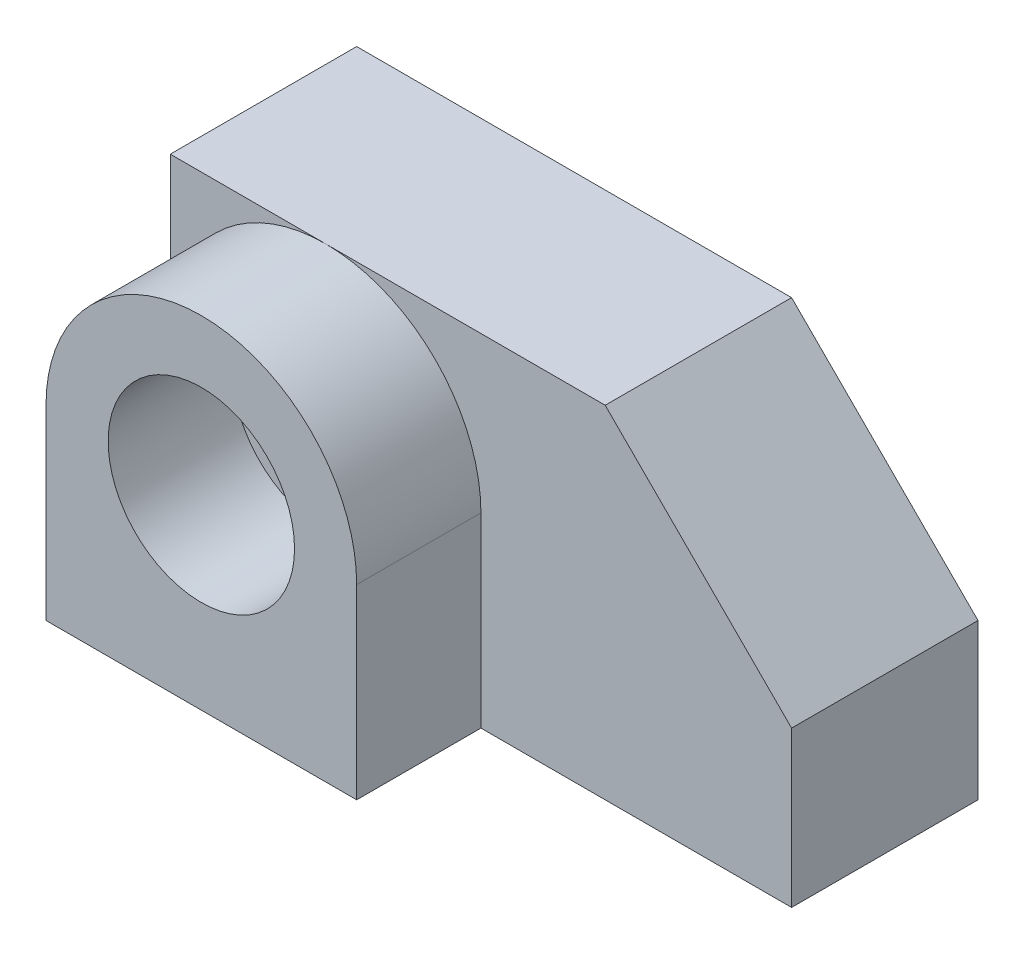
ISO-10303-21;
HEADER;
FILE_DESCRIPTION(('STEP AP214'),'2;1');
FILE_NAME('part.step','',(''),(''),'','','');
FILE_SCHEMA(('AUTOMOTIVE_DESIGN { 1 0 10303 214 1 1 1 1 }'));
ENDSEC;
DATA;
#1=APPLICATION_CONTEXT('core data for automotive mechanical design processes');
#2=APPLICATION_PROTOCOL_DEFINITION('international standard','automotive_design',2000,#1);
#3=PRODUCT_CONTEXT('',#1,'mechanical');
#4=PRODUCT('Part','Part','',(#3));
#5=PRODUCT_RELATED_PRODUCT_CATEGORY('part','',(#4));
#6=PRODUCT_DEFINITION_FORMATION('','',#4);
#7=PRODUCT_DEFINITION_CONTEXT('part definition',#1,'design');
#8=PRODUCT_DEFINITION('design','',#6,#7);
#9=PRODUCT_DEFINITION_SHAPE('','',#8);
#10=(LENGTH_UNIT() NAMED_UNIT(*) SI_UNIT(.MILLI.,.METRE.));
#11=(NAMED_UNIT(*) PLANE_ANGLE_UNIT() SI_UNIT($,.RADIAN.));
#12=(NAMED_UNIT(*) SI_UNIT($,.STERADIAN.) SOLID_ANGLE_UNIT());
#13=UNCERTAINTY_MEASURE_WITH_UNIT(LENGTH_MEASURE(1.E-05),#10,'distance_accuracy_value','');
#14=(GEOMETRIC_REPRESENTATION_CONTEXT(3) GLOBAL_UNCERTAINTY_ASSIGNED_CONTEXT((#13)) GLOBAL_UNIT_ASSIGNED_CONTEXT((#10,
#11,#12)) REPRESENTATION_CONTEXT('',''));
#15=CARTESIAN_POINT('',(0.,0.,0.));
#16=DIRECTION('',(0.,0.,1.));
#17=DIRECTION('',(1.,0.,0.));
#18=AXIS2_PLACEMENT_3D('',#15,#16,#17);
#19=CARTESIAN_POINT('',(-50.,55.,0.));
#20=DIRECTION('',(0.,0.,-1.));
#21=DIRECTION('',(-1.,0.,0.));
#22=AXIS2_PLACEMENT_3D('',#19,#20,#21);
#23=PLANE('',#22);
#24=CARTESIAN_POINT('',(-25.,30.,0.));
#25=DIRECTION('',(0.,0.,1.));
#26=DIRECTION('',(1.,0.,0.));
#27=AXIS2_PLACEMENT_3D('',#24,#25,#26);
#28=CIRCLE('',#27,25.);
#29=CARTESIAN_POINT('',(-25.,55.,0.));
#30=VERTEX_POINT('',#29);
#31=CARTESIAN_POINT('',(-50.,30.,0.));
#32=VERTEX_POINT('',#31);
#33=EDGE_CURVE('E11',#30,#32,#28,.T.);
#34=ORIENTED_EDGE('',*,*,#33,.F.);
#35=DIRECTION('',(-1.,0.,0.));
#36=VECTOR('',#35,1.);
#37=CARTESIAN_POINT('',(-50.,55.,0.));
#38=LINE('',#37,#36);
#39=CARTESIAN_POINT('',(-50.,55.,0.));
#40=VERTEX_POINT('',#39);
#41=EDGE_CURVE('E175',#30,#40,#38,.T.);
#42=ORIENTED_EDGE('',*,*,#41,.T.);
#43=DIRECTION('',(0.,-1.,0.));
#44=VECTOR('',#43,1.);
#45=CARTESIAN_POINT('',(-50.,0.,0.));
#46=LINE('',#45,#44);
#47=EDGE_CURVE('E56',#40,#32,#46,.T.);
#48=ORIENTED_EDGE('',*,*,#47,.T.);
#49=EDGE_LOOP('',(#34,#42,#48));
#50=FACE_BOUND('',#49,.T.);
#51=ADVANCED_FACE('F31',(#50),#23,.F.);
#52=CARTESIAN_POINT('',(0.,30.,0.));
#53=VERTEX_POINT('',#52);
#54=EDGE_CURVE('E134',#53,#30,#28,.T.);
#55=ORIENTED_EDGE('',*,*,#54,.F.);
#56=DIRECTION('',(0.,1.,0.));
#57=VECTOR('',#56,1.);
#58=CARTESIAN_POINT('',(0.,0.,0.));
#59=LINE('',#58,#57);
#60=CARTESIAN_POINT('',(0.,0.,0.));
#61=VERTEX_POINT('',#60);
#62=EDGE_CURVE('E48',#61,#53,#59,.T.);
#63=ORIENTED_EDGE('',*,*,#62,.F.);
#64=DIRECTION('',(1.,0.,0.));
#65=VECTOR('',#64,1.);
#66=CARTESIAN_POINT('',(-50.,0.,0.));
#67=LINE('',#66,#65);
#68=CARTESIAN_POINT('',(50.,0.,0.));
#69=VERTEX_POINT('',#68);
#70=EDGE_CURVE('E124',#61,#69,#67,.T.);
#71=ORIENTED_EDGE('',*,*,#70,.T.);
#72=DIRECTION('',(0.,1.,0.));
#73=VECTOR('',#72,1.);
#74=CARTESIAN_POINT('',(50.,0.,0.));
#75=LINE('',#74,#73);
#76=CARTESIAN_POINT('',(50.,25.,0.));
#77=VERTEX_POINT('',#76);
#78=EDGE_CURVE('E176',#69,#77,#75,.T.);
#79=ORIENTED_EDGE('',*,*,#78,.T.);
#80=DIRECTION('',(0.707106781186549,-0.707106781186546,0.));
#81=VECTOR('',#80,1.);
#82=CARTESIAN_POINT('',(50.,25.,0.));
#83=LINE('',#82,#81);
#84=CARTESIAN_POINT('',(19.9999999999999,55.,0.));
#85=VERTEX_POINT('',#84);
#86=EDGE_CURVE('E162',#77,#85,#83,.F.);
#87=ORIENTED_EDGE('',*,*,#86,.T.);
#88=EDGE_CURVE('E147',#85,#30,#38,.T.);
#89=ORIENTED_EDGE('',*,*,#88,.T.);
#90=EDGE_LOOP('',(#55,#63,#71,#79,#87,#89));
#91=FACE_BOUND('',#90,.T.);
#92=ADVANCED_FACE('F179',(#91),#23,.F.);
#93=CARTESIAN_POINT('',(-50.,0.,-30.));
#94=DIRECTION('',(-1.,0.,0.));
#95=DIRECTION('',(0.,0.,1.));
#96=AXIS2_PLACEMENT_3D('',#93,#94,#95);
#97=PLANE('',#96);
#98=ORIENTED_EDGE('',*,*,#47,.F.);
#99=DIRECTION('',(0.,0.,1.));
#100=VECTOR('',#99,1.);
#101=CARTESIAN_POINT('',(-50.,55.,-30.));
#102=LINE('',#101,#100);
#103=CARTESIAN_POINT('',(-50.,55.,-30.));
#104=VERTEX_POINT('',#103);
#105=EDGE_CURVE('E167',#104,#40,#102,.T.);
#106=ORIENTED_EDGE('',*,*,#105,.F.);
#107=DIRECTION('',(0.,-1.,0.));
#108=VECTOR('',#107,1.);
#109=CARTESIAN_POINT('',(-50.,0.,-30.));
#110=LINE('',#109,#108);
#111=CARTESIAN_POINT('',(-50.,0.,-30.));
#112=VERTEX_POINT('',#111);
#113=EDGE_CURVE('E144',#104,#112,#110,.T.);
#114=ORIENTED_EDGE('',*,*,#113,.T.);
#115=DIRECTION('',(0.,0.,1.));
#116=VECTOR('',#115,1.);
#117=CARTESIAN_POINT('',(-50.,0.,-30.));
#118=LINE('',#117,#116);
#119=CARTESIAN_POINT('',(-50.,0.,20.));
#120=VERTEX_POINT('',#119);
#121=EDGE_CURVE('E106',#112,#120,#118,.T.);
#122=ORIENTED_EDGE('',*,*,#121,.T.);
#123=DIRECTION('',(0.,-1.,0.));
#124=VECTOR('',#123,1.);
#125=CARTESIAN_POINT('',(-50.,30.,20.));
#126=LINE('',#125,#124);
#127=CARTESIAN_POINT('',(-50.,30.,20.));
#128=VERTEX_POINT('',#127);
#129=EDGE_CURVE('E100',#128,#120,#126,.T.);
#130=ORIENTED_EDGE('',*,*,#129,.F.);
#131=DIRECTION('',(0.,0.,-1.));
#132=VECTOR('',#131,1.);
#133=CARTESIAN_POINT('',(-50.,30.,20.));
#134=LINE('',#133,#132);
#135=EDGE_CURVE('E104',#128,#32,#134,.T.);
#136=ORIENTED_EDGE('',*,*,#135,.T.);
#137=EDGE_LOOP('',(#98,#106,#114,#122,#130,#136));
#138=FACE_BOUND('',#137,.T.);
#139=ADVANCED_FACE('F102',(#138),#97,.T.);
#140=CARTESIAN_POINT('',(-50.,55.,-30.));
#141=DIRECTION('',(0.,1.,0.));
#142=DIRECTION('',(0.,0.,1.));
#143=AXIS2_PLACEMENT_3D('',#140,#141,#142);
#144=PLANE('',#143);
#145=ORIENTED_EDGE('',*,*,#88,.F.);
#146=DIRECTION('',(0.,0.,-1.));
#147=VECTOR('',#146,1.);
#148=CARTESIAN_POINT('',(19.9999999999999,55.,-30.));
#149=LINE('',#148,#147);
#150=CARTESIAN_POINT('',(19.9999999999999,55.,-30.));
#151=VERTEX_POINT('',#150);
#152=EDGE_CURVE('E160',#85,#151,#149,.T.);
#153=ORIENTED_EDGE('',*,*,#152,.T.);
#154=DIRECTION('',(-1.,0.,0.));
#155=VECTOR('',#154,1.);
#156=CARTESIAN_POINT('',(-50.,55.,-30.));
#157=LINE('',#156,#155);
#158=EDGE_CURVE('E153',#151,#104,#157,.T.);
#159=ORIENTED_EDGE('',*,*,#158,.T.);
#160=ORIENTED_EDGE('',*,*,#105,.T.);
#161=ORIENTED_EDGE('',*,*,#41,.F.);
#162=EDGE_LOOP('',(#145,#153,#159,#160,#161));
#163=FACE_BOUND('',#162,.T.);
#164=ADVANCED_FACE('F194',(#163),#144,.T.);
#165=CARTESIAN_POINT('',(50.,0.,-30.));
#166=DIRECTION('',(1.,0.,0.));
#167=DIRECTION('',(0.,0.,-1.));
#168=AXIS2_PLACEMENT_3D('',#165,#166,#167);
#169=PLANE('',#168);
#170=DIRECTION('',(0.,1.,0.));
#171=VECTOR('',#170,1.);
#172=CARTESIAN_POINT('',(50.,0.,-30.));
#173=LINE('',#172,#171);
#174=CARTESIAN_POINT('',(50.,0.,-30.));
#175=VERTEX_POINT('',#174);
#176=CARTESIAN_POINT('',(50.,25.,-30.));
#177=VERTEX_POINT('',#176);
#178=EDGE_CURVE('E150',#175,#177,#173,.T.);
#179=ORIENTED_EDGE('',*,*,#178,.T.);
#180=DIRECTION('',(0.,0.,1.));
#181=VECTOR('',#180,1.);
#182=CARTESIAN_POINT('',(50.,25.,-30.));
#183=LINE('',#182,#181);
#184=EDGE_CURVE('E164',#177,#77,#183,.T.);
#185=ORIENTED_EDGE('',*,*,#184,.T.);
#186=ORIENTED_EDGE('',*,*,#78,.F.);
#187=DIRECTION('',(0.,0.,1.));
#188=VECTOR('',#187,1.);
#189=CARTESIAN_POINT('',(50.,0.,-30.));
#190=LINE('',#189,#188);
#191=EDGE_CURVE('E169',#175,#69,#190,.T.);
#192=ORIENTED_EDGE('',*,*,#191,.F.);
#193=EDGE_LOOP('',(#179,#185,#186,#192));
#194=FACE_BOUND('',#193,.T.);
#195=ADVANCED_FACE('F186',(#194),#169,.T.);
#196=CARTESIAN_POINT('',(-50.,0.,-30.));
#197=DIRECTION('',(0.,-1.,0.));
#198=DIRECTION('',(0.,0.,-1.));
#199=AXIS2_PLACEMENT_3D('',#196,#197,#198);
#200=PLANE('',#199);
#201=ORIENTED_EDGE('',*,*,#70,.F.);
#202=DIRECTION('',(0.,0.,-1.));
#203=VECTOR('',#202,1.);
#204=CARTESIAN_POINT('',(0.,0.,20.));
#205=LINE('',#204,#203);
#206=CARTESIAN_POINT('',(0.,0.,20.));
#207=VERTEX_POINT('',#206);
#208=EDGE_CURVE('E123',#207,#61,#205,.T.);
#209=ORIENTED_EDGE('',*,*,#208,.F.);
#210=DIRECTION('',(1.,0.,0.));
#211=VECTOR('',#210,1.);
#212=CARTESIAN_POINT('',(-50.,0.,20.));
#213=LINE('',#212,#211);
#214=EDGE_CURVE('E109',#120,#207,#213,.T.);
#215=ORIENTED_EDGE('',*,*,#214,.F.);
#216=ORIENTED_EDGE('',*,*,#121,.F.);
#217=DIRECTION('',(1.,0.,0.));
#218=VECTOR('',#217,1.);
#219=CARTESIAN_POINT('',(-50.,0.,-30.));
#220=LINE('',#219,#218);
#221=EDGE_CURVE('E146',#112,#175,#220,.T.);
#222=ORIENTED_EDGE('',*,*,#221,.T.);
#223=ORIENTED_EDGE('',*,*,#191,.T.);
#224=EDGE_LOOP('',(#201,#209,#215,#216,#222,#223));
#225=FACE_BOUND('',#224,.T.);
#226=ADVANCED_FACE('F182',(#225),#200,.T.);
#227=CARTESIAN_POINT('',(-50.,55.,-30.));
#228=DIRECTION('',(0.,0.,-1.));
#229=DIRECTION('',(-1.,0.,0.));
#230=AXIS2_PLACEMENT_3D('',#227,#228,#229);
#231=PLANE('',#230);
#232=ORIENTED_EDGE('',*,*,#158,.F.);
#233=DIRECTION('',(-0.707106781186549,0.707106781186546,0.));
#234=VECTOR('',#233,1.);
#235=CARTESIAN_POINT('',(-15.0000000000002,90.,-30.));
#236=LINE('',#235,#234);
#237=EDGE_CURVE('E40',#151,#177,#236,.F.);
#238=ORIENTED_EDGE('',*,*,#237,.T.);
#239=ORIENTED_EDGE('',*,*,#178,.F.);
#240=ORIENTED_EDGE('',*,*,#221,.F.);
#241=ORIENTED_EDGE('',*,*,#113,.F.);
#242=EDGE_LOOP('',(#232,#238,#239,#240,#241));
#243=FACE_BOUND('',#242,.T.);
#244=ADVANCED_FACE('F229',(#243),#231,.T.);
#245=CARTESIAN_POINT('',(50.,25.,-30.));
#246=DIRECTION('',(-0.707106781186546,-0.707106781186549,0.));
#247=DIRECTION('',(0.707106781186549,-0.707106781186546,0.));
#248=AXIS2_PLACEMENT_3D('',#245,#246,#247);
#249=PLANE('',#248);
#250=ORIENTED_EDGE('',*,*,#237,.F.);
#251=ORIENTED_EDGE('',*,*,#152,.F.);
#252=ORIENTED_EDGE('',*,*,#86,.F.);
#253=ORIENTED_EDGE('',*,*,#184,.F.);
#254=EDGE_LOOP('',(#250,#251,#252,#253));
#255=FACE_BOUND('',#254,.T.);
#256=ADVANCED_FACE('F33',(#255),#249,.F.);
#257=CARTESIAN_POINT('',(-25.,30.,20.));
#258=DIRECTION('',(0.,0.,1.));
#259=DIRECTION('',(1.,0.,0.));
#260=AXIS2_PLACEMENT_3D('',#257,#258,#259);
#261=PLANE('',#260);
#262=CARTESIAN_POINT('',(-25.,30.,20.));
#263=DIRECTION('',(0.,0.,1.));
#264=DIRECTION('',(1.,0.,0.));
#265=AXIS2_PLACEMENT_3D('',#262,#263,#264);
#266=CIRCLE('',#265,25.);
#267=CARTESIAN_POINT('',(0.,30.,20.));
#268=VERTEX_POINT('',#267);
#269=EDGE_CURVE('E110',#268,#128,#266,.T.);
#270=ORIENTED_EDGE('',*,*,#269,.T.);
#271=ORIENTED_EDGE('',*,*,#129,.T.);
#272=ORIENTED_EDGE('',*,*,#214,.T.);
#273=DIRECTION('',(0.,1.,0.));
#274=VECTOR('',#273,1.);
#275=CARTESIAN_POINT('',(0.,0.,20.));
#276=LINE('',#275,#274);
#277=EDGE_CURVE('E116',#207,#268,#276,.T.);
#278=ORIENTED_EDGE('',*,*,#277,.T.);
#279=EDGE_LOOP('',(#270,#271,#272,#278));
#280=FACE_BOUND('',#279,.T.);
#281=CARTESIAN_POINT('',(-25.,30.,20.));
#282=DIRECTION('',(0.,0.,1.));
#283=DIRECTION('',(1.,0.,0.));
#284=AXIS2_PLACEMENT_3D('',#281,#282,#283);
#285=CIRCLE('',#284,15.);
#286=CARTESIAN_POINT('',(-10.,30.,20.));
#287=VERTEX_POINT('',#286);
#288=EDGE_CURVE('E141',#287,#287,#285,.T.);
#289=ORIENTED_EDGE('',*,*,#288,.F.);
#290=EDGE_LOOP('',(#289));
#291=FACE_BOUND('',#290,.T.);
#292=ADVANCED_FACE('F113',(#280,#291),#261,.T.);
#293=CARTESIAN_POINT('',(-25.,30.,20.));
#294=DIRECTION('',(0.,0.,-1.));
#295=DIRECTION('',(-1.,0.,0.));
#296=AXIS2_PLACEMENT_3D('',#293,#294,#295);
#297=CYLINDRICAL_SURFACE('',#296,25.);
#298=ORIENTED_EDGE('',*,*,#54,.T.);
#299=ORIENTED_EDGE('',*,*,#33,.T.);
#300=ORIENTED_EDGE('',*,*,#135,.F.);
#301=ORIENTED_EDGE('',*,*,#269,.F.);
#302=DIRECTION('',(0.,0.,-1.));
#303=VECTOR('',#302,1.);
#304=CARTESIAN_POINT('',(0.,30.,20.));
#305=LINE('',#304,#303);
#306=EDGE_CURVE('E127',#268,#53,#305,.T.);
#307=ORIENTED_EDGE('',*,*,#306,.T.);
#308=EDGE_LOOP('',(#298,#299,#300,#301,#307));
#309=FACE_BOUND('',#308,.T.);
#310=ADVANCED_FACE('F122',(#309),#297,.T.);
#311=CARTESIAN_POINT('',(0.,0.,20.));
#312=DIRECTION('',(-1.,0.,0.));
#313=DIRECTION('',(0.,0.,1.));
#314=AXIS2_PLACEMENT_3D('',#311,#312,#313);
#315=PLANE('',#314);
#316=ORIENTED_EDGE('',*,*,#62,.T.);
#317=ORIENTED_EDGE('',*,*,#306,.F.);
#318=ORIENTED_EDGE('',*,*,#277,.F.);
#319=ORIENTED_EDGE('',*,*,#208,.T.);
#320=EDGE_LOOP('',(#316,#317,#318,#319));
#321=FACE_BOUND('',#320,.T.);
#322=ADVANCED_FACE('F211',(#321),#315,.F.);
#323=CARTESIAN_POINT('',(-25.,30.,20.));
#324=DIRECTION('',(0.,0.,-1.));
#325=DIRECTION('',(-1.,0.,0.));
#326=AXIS2_PLACEMENT_3D('',#323,#324,#325);
#327=CYLINDRICAL_SURFACE('',#326,15.);
#328=ORIENTED_EDGE('',*,*,#288,.T.);
#329=EDGE_LOOP('',(#328));
#330=FACE_BOUND('',#329,.T.);
#331=CARTESIAN_POINT('',(-25.,30.,0.));
#332=DIRECTION('',(0.,0.,1.));
#333=DIRECTION('',(1.,0.,0.));
#334=AXIS2_PLACEMENT_3D('',#331,#332,#333);
#335=CIRCLE('',#334,15.);
#336=CARTESIAN_POINT('',(-10.,30.,0.));
#337=VERTEX_POINT('',#336);
#338=EDGE_CURVE('E216',#337,#337,#335,.T.);
#339=ORIENTED_EDGE('',*,*,#338,.F.);
#340=EDGE_LOOP('',(#339));
#341=FACE_BOUND('',#340,.T.);
#342=ADVANCED_FACE('F206',(#330,#341),#327,.F.);
#343=ORIENTED_EDGE('',*,*,#338,.T.);
#344=EDGE_LOOP('',(#343));
#345=FACE_BOUND('',#344,.T.);
#346=ADVANCED_FACE('F199',(#345),#23,.F.);
#347=CLOSED_SHELL('',(#51,#92,#139,#164,#195,#226,#244,#256,#292,#310,#322,#342,#346));
#348=MANIFOLD_SOLID_BREP('B2',#347);
#349=ADVANCED_BREP_SHAPE_REPRESENTATION('',(#18,#348),#14);
#350=SHAPE_DEFINITION_REPRESENTATION(#9,#349);
ENDSEC;
END-ISO-10303-21;
